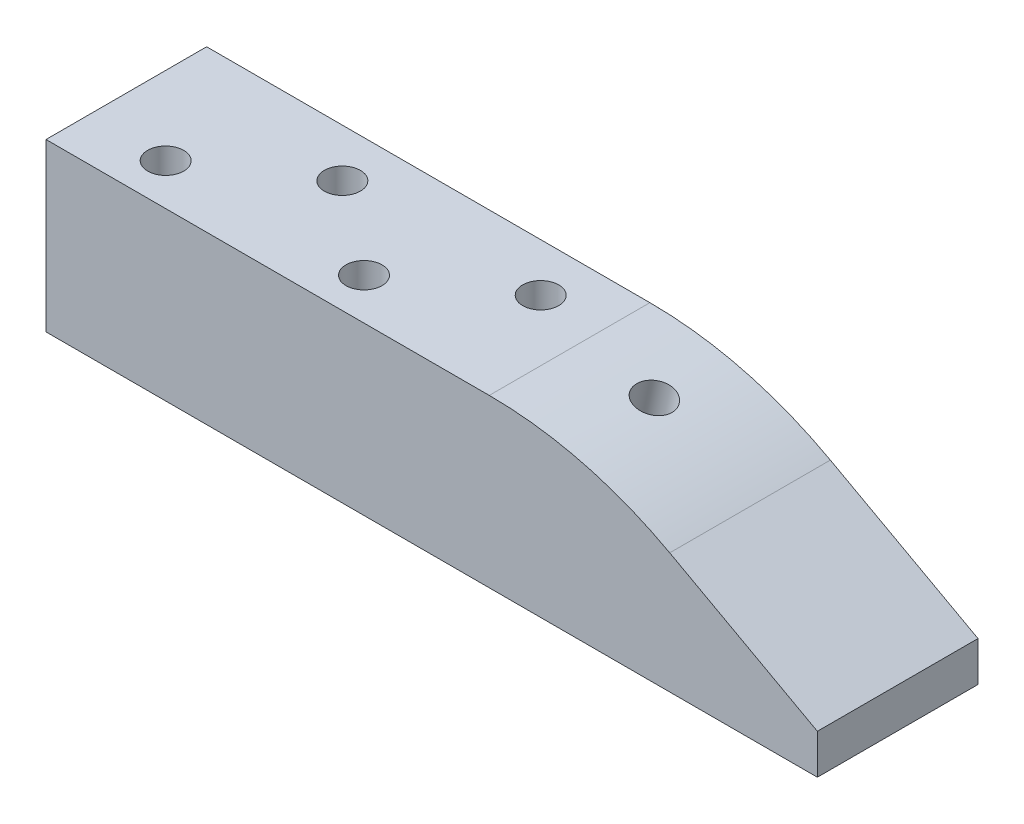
ISO-10303-21;
HEADER;
FILE_DESCRIPTION(('STEP AP214'),'2;1');
FILE_NAME('part.step','',(''),(''),'','','');
FILE_SCHEMA(('AUTOMOTIVE_DESIGN { 1 0 10303 214 1 1 1 1 }'));
ENDSEC;
DATA;
#1=APPLICATION_CONTEXT('core data for automotive mechanical design processes');
#2=APPLICATION_PROTOCOL_DEFINITION('international standard','automotive_design',2000,#1);
#3=PRODUCT_CONTEXT('',#1,'mechanical');
#4=PRODUCT('Part','Part','',(#3));
#5=PRODUCT_RELATED_PRODUCT_CATEGORY('part','',(#4));
#6=PRODUCT_DEFINITION_FORMATION('','',#4);
#7=PRODUCT_DEFINITION_CONTEXT('part definition',#1,'design');
#8=PRODUCT_DEFINITION('design','',#6,#7);
#9=PRODUCT_DEFINITION_SHAPE('','',#8);
#10=(LENGTH_UNIT() NAMED_UNIT(*) SI_UNIT(.MILLI.,.METRE.));
#11=(NAMED_UNIT(*) PLANE_ANGLE_UNIT() SI_UNIT($,.RADIAN.));
#12=(NAMED_UNIT(*) SI_UNIT($,.STERADIAN.) SOLID_ANGLE_UNIT());
#13=UNCERTAINTY_MEASURE_WITH_UNIT(LENGTH_MEASURE(1.E-05),#10,'distance_accuracy_value','');
#14=(GEOMETRIC_REPRESENTATION_CONTEXT(3) GLOBAL_UNCERTAINTY_ASSIGNED_CONTEXT((#13)) GLOBAL_UNIT_ASSIGNED_CONTEXT((#10,
#11,#12)) REPRESENTATION_CONTEXT('',''));
#15=CARTESIAN_POINT('',(0.,0.,0.));
#16=DIRECTION('',(0.,0.,1.));
#17=DIRECTION('',(1.,0.,0.));
#18=AXIS2_PLACEMENT_3D('',#15,#16,#17);
#19=CARTESIAN_POINT('',(-178.660059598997,92.4224475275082,-43.2877703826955));
#20=DIRECTION('',(1.,0.,0.));
#21=DIRECTION('',(0.,0.,-1.));
#22=AXIS2_PLACEMENT_3D('',#19,#20,#21);
#23=PLANE('',#22);
#24=DIRECTION('',(0.,0.,1.));
#25=VECTOR('',#24,1.);
#26=CARTESIAN_POINT('',(-178.660059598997,0.,-43.2877703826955));
#27=LINE('',#26,#25);
#28=CARTESIAN_POINT('',(-178.660059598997,0.,-43.2877703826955));
#29=VERTEX_POINT('',#28);
#30=CARTESIAN_POINT('',(-178.660059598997,0.,45.8024126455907));
#31=VERTEX_POINT('',#30);
#32=EDGE_CURVE('E147',#29,#31,#27,.T.);
#33=ORIENTED_EDGE('',*,*,#32,.T.);
#34=DIRECTION('',(0.,-1.,0.));
#35=VECTOR('',#34,1.);
#36=CARTESIAN_POINT('',(-178.660059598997,92.4224475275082,45.8024126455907));
#37=LINE('',#36,#35);
#38=CARTESIAN_POINT('',(-178.660059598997,92.4224475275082,45.8024126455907));
#39=VERTEX_POINT('',#38);
#40=EDGE_CURVE('E92',#39,#31,#37,.T.);
#41=ORIENTED_EDGE('',*,*,#40,.F.);
#42=DIRECTION('',(0.,0.,1.));
#43=VECTOR('',#42,1.);
#44=CARTESIAN_POINT('',(-178.660059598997,92.4224475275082,-43.2877703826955));
#45=LINE('',#44,#43);
#46=CARTESIAN_POINT('',(-178.660059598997,92.4224475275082,-43.2877703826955));
#47=VERTEX_POINT('',#46);
#48=EDGE_CURVE('E154',#47,#39,#45,.T.);
#49=ORIENTED_EDGE('',*,*,#48,.F.);
#50=DIRECTION('',(0.,-1.,0.));
#51=VECTOR('',#50,1.);
#52=CARTESIAN_POINT('',(-178.660059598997,92.4224475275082,-43.2877703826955));
#53=LINE('',#52,#51);
#54=EDGE_CURVE('E160',#47,#29,#53,.T.);
#55=ORIENTED_EDGE('',*,*,#54,.T.);
#56=EDGE_LOOP('',(#33,#41,#49,#55));
#57=FACE_BOUND('',#56,.T.);
#58=ADVANCED_FACE('F31',(#57),#23,.F.);
#59=CARTESIAN_POINT('',(-178.660059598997,92.4224475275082,45.8024126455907));
#60=DIRECTION('',(0.,0.,-1.));
#61=DIRECTION('',(-1.,0.,0.));
#62=AXIS2_PLACEMENT_3D('',#59,#60,#61);
#63=PLANE('',#62);
#64=DIRECTION('',(1.,0.,0.));
#65=VECTOR('',#64,1.);
#66=CARTESIAN_POINT('',(-178.660059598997,0.,45.8024126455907));
#67=LINE('',#66,#65);
#68=CARTESIAN_POINT('',(249.144823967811,0.,45.8024126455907));
#69=VERTEX_POINT('',#68);
#70=EDGE_CURVE('E150',#31,#69,#67,.T.);
#71=ORIENTED_EDGE('',*,*,#70,.T.);
#72=DIRECTION('',(0.,1.,0.));
#73=VECTOR('',#72,1.);
#74=CARTESIAN_POINT('',(249.144823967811,22.0839510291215,45.8024126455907));
#75=LINE('',#74,#73);
#76=CARTESIAN_POINT('',(249.144823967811,22.0839510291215,45.8024126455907));
#77=VERTEX_POINT('',#76);
#78=EDGE_CURVE('E115',#69,#77,#75,.T.);
#79=ORIENTED_EDGE('',*,*,#78,.T.);
#80=DIRECTION('',(-0.877433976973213,0.479697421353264,0.));
#81=VECTOR('',#80,1.);
#82=CARTESIAN_POINT('',(167.260924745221,66.8502768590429,45.8024126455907));
#83=LINE('',#82,#81);
#84=CARTESIAN_POINT('',(167.260924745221,66.8502768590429,45.8024126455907));
#85=VERTEX_POINT('',#84);
#86=EDGE_CURVE('E109',#77,#85,#83,.T.);
#87=ORIENTED_EDGE('',*,*,#86,.T.);
#88=CARTESIAN_POINT('',(67.1768718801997,-116.217516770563,45.8024126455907));
#89=DIRECTION('',(0.,0.,1.));
#90=DIRECTION('',(-1.,0.,0.));
#91=AXIS2_PLACEMENT_3D('',#88,#89,#90);
#92=CIRCLE('',#91,208.639964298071);
#93=CARTESIAN_POINT('',(67.1768718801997,92.4224475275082,45.8024126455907));
#94=VERTEX_POINT('',#93);
#95=EDGE_CURVE('E101',#85,#94,#92,.T.);
#96=ORIENTED_EDGE('',*,*,#95,.T.);
#97=DIRECTION('',(1.,0.,0.));
#98=VECTOR('',#97,1.);
#99=CARTESIAN_POINT('',(-178.660059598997,92.4224475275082,45.8024126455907));
#100=LINE('',#99,#98);
#101=EDGE_CURVE('E156',#39,#94,#100,.T.);
#102=ORIENTED_EDGE('',*,*,#101,.F.);
#103=ORIENTED_EDGE('',*,*,#40,.T.);
#104=EDGE_LOOP('',(#71,#79,#87,#96,#102,#103));
#105=FACE_BOUND('',#104,.T.);
#106=ADVANCED_FACE('F113',(#105),#63,.F.);
#107=CARTESIAN_POINT('',(-178.660059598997,92.4224475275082,-43.2877703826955));
#108=DIRECTION('',(0.,0.,1.));
#109=DIRECTION('',(1.,0.,0.));
#110=AXIS2_PLACEMENT_3D('',#107,#108,#109);
#111=PLANE('',#110);
#112=DIRECTION('',(-1.,0.,0.));
#113=VECTOR('',#112,1.);
#114=CARTESIAN_POINT('',(-178.660059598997,0.,-43.2877703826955));
#115=LINE('',#114,#113);
#116=CARTESIAN_POINT('',(249.144823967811,0.,-43.2877703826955));
#117=VERTEX_POINT('',#116);
#118=EDGE_CURVE('E152',#117,#29,#115,.T.);
#119=ORIENTED_EDGE('',*,*,#118,.T.);
#120=ORIENTED_EDGE('',*,*,#54,.F.);
#121=DIRECTION('',(-1.,0.,0.));
#122=VECTOR('',#121,1.);
#123=CARTESIAN_POINT('',(-178.660059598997,92.4224475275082,-43.2877703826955));
#124=LINE('',#123,#122);
#125=CARTESIAN_POINT('',(67.1768718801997,92.4224475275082,-43.2877703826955));
#126=VERTEX_POINT('',#125);
#127=EDGE_CURVE('E54',#126,#47,#124,.T.);
#128=ORIENTED_EDGE('',*,*,#127,.F.);
#129=CARTESIAN_POINT('',(67.1768718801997,-116.217516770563,-43.2877703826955));
#130=DIRECTION('',(0.,0.,1.));
#131=DIRECTION('',(-1.,0.,0.));
#132=AXIS2_PLACEMENT_3D('',#129,#130,#131);
#133=CIRCLE('',#132,208.639964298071);
#134=CARTESIAN_POINT('',(167.260924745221,66.8502768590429,-43.2877703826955));
#135=VERTEX_POINT('',#134);
#136=EDGE_CURVE('E127',#135,#126,#133,.T.);
#137=ORIENTED_EDGE('',*,*,#136,.F.);
#138=DIRECTION('',(-0.877433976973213,0.479697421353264,0.));
#139=VECTOR('',#138,1.);
#140=CARTESIAN_POINT('',(167.260924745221,66.8502768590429,-43.2877703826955));
#141=LINE('',#140,#139);
#142=CARTESIAN_POINT('',(249.144823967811,22.0839510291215,-43.2877703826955));
#143=VERTEX_POINT('',#142);
#144=EDGE_CURVE('E124',#143,#135,#141,.T.);
#145=ORIENTED_EDGE('',*,*,#144,.F.);
#146=DIRECTION('',(0.,1.,0.));
#147=VECTOR('',#146,1.);
#148=CARTESIAN_POINT('',(249.144823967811,22.0839510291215,-43.2877703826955));
#149=LINE('',#148,#147);
#150=EDGE_CURVE('E108',#117,#143,#149,.T.);
#151=ORIENTED_EDGE('',*,*,#150,.F.);
#152=EDGE_LOOP('',(#119,#120,#128,#137,#145,#151));
#153=FACE_BOUND('',#152,.T.);
#154=ADVANCED_FACE('F175',(#153),#111,.F.);
#155=CARTESIAN_POINT('',(-178.660059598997,92.4224475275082,45.8024126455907));
#156=DIRECTION('',(0.,1.,0.));
#157=DIRECTION('',(0.,0.,1.));
#158=AXIS2_PLACEMENT_3D('',#155,#156,#157);
#159=PLANE('',#158);
#160=CARTESIAN_POINT('',(-76.6620544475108,92.4224475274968,-16.559332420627));
#161=DIRECTION('',(0.,1.,0.));
#162=DIRECTION('',(0.,0.,1.));
#163=AXIS2_PLACEMENT_3D('',#160,#161,#162);
#164=CIRCLE('',#163,10.);
#165=CARTESIAN_POINT('',(-76.6620544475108,92.4224475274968,-6.55933242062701));
#166=VERTEX_POINT('',#165);
#167=EDGE_CURVE('E350',#166,#166,#164,.T.);
#168=ORIENTED_EDGE('',*,*,#167,.F.);
#169=EDGE_LOOP('',(#168));
#170=FACE_BOUND('',#169,.T.);
#171=CARTESIAN_POINT('',(-135.279241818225,92.4224475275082,22.8147983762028));
#172=DIRECTION('',(0.,1.,0.));
#173=DIRECTION('',(0.,0.,1.));
#174=AXIS2_PLACEMENT_3D('',#171,#172,#173);
#175=CIRCLE('',#174,10.);
#176=CARTESIAN_POINT('',(-135.279241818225,92.4224475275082,32.8147983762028));
#177=VERTEX_POINT('',#176);
#178=EDGE_CURVE('E349',#177,#177,#175,.T.);
#179=ORIENTED_EDGE('',*,*,#178,.F.);
#180=EDGE_LOOP('',(#179));
#181=FACE_BOUND('',#180,.T.);
#182=CARTESIAN_POINT('',(33.3379455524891,92.4224475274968,-16.559332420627));
#183=DIRECTION('',(0.,1.,0.));
#184=DIRECTION('',(0.,0.,1.));
#185=AXIS2_PLACEMENT_3D('',#182,#183,#184);
#186=CIRCLE('',#185,10.);
#187=CARTESIAN_POINT('',(33.3379455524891,92.4224475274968,-6.55933242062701));
#188=VERTEX_POINT('',#187);
#189=EDGE_CURVE('E131',#188,#188,#186,.T.);
#190=ORIENTED_EDGE('',*,*,#189,.F.);
#191=EDGE_LOOP('',(#190));
#192=FACE_BOUND('',#191,.T.);
#193=CARTESIAN_POINT('',(-25.2792418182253,92.4224475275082,22.8147983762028));
#194=DIRECTION('',(0.,1.,0.));
#195=DIRECTION('',(0.,0.,1.));
#196=AXIS2_PLACEMENT_3D('',#193,#194,#195);
#197=CIRCLE('',#196,10.);
#198=CARTESIAN_POINT('',(-25.2792418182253,92.4224475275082,32.8147983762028));
#199=VERTEX_POINT('',#198);
#200=EDGE_CURVE('E141',#199,#199,#197,.T.);
#201=ORIENTED_EDGE('',*,*,#200,.F.);
#202=EDGE_LOOP('',(#201));
#203=FACE_BOUND('',#202,.T.);
#204=ORIENTED_EDGE('',*,*,#48,.T.);
#205=ORIENTED_EDGE('',*,*,#101,.T.);
#206=DIRECTION('',(0.,0.,-1.));
#207=VECTOR('',#206,1.);
#208=CARTESIAN_POINT('',(67.1768718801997,92.4224475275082,-43.2877703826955));
#209=LINE('',#208,#207);
#210=EDGE_CURVE('E106',#94,#126,#209,.T.);
#211=ORIENTED_EDGE('',*,*,#210,.T.);
#212=ORIENTED_EDGE('',*,*,#127,.T.);
#213=EDGE_LOOP('',(#204,#205,#211,#212));
#214=FACE_BOUND('',#213,.T.);
#215=ADVANCED_FACE('F176',(#170,#181,#192,#203,#214),#159,.T.);
#216=CARTESIAN_POINT('',(-178.660059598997,0.,45.8024126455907));
#217=DIRECTION('',(0.,1.,0.));
#218=DIRECTION('',(0.,0.,1.));
#219=AXIS2_PLACEMENT_3D('',#216,#217,#218);
#220=PLANE('',#219);
#221=CARTESIAN_POINT('',(91.3563333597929,0.,-3.29323391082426));
#222=DIRECTION('',(0.,1.,0.));
#223=DIRECTION('',(1.,0.,0.));
#224=AXIS2_PLACEMENT_3D('',#221,#222,#223);
#225=ELLIPSE('',#224,10.2141385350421,9.99999999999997);
#226=CARTESIAN_POINT('',(101.570471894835,0.,-3.29323391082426));
#227=VERTEX_POINT('',#226);
#228=EDGE_CURVE('E118',#227,#227,#225,.T.);
#229=ORIENTED_EDGE('',*,*,#228,.T.);
#230=EDGE_LOOP('',(#229));
#231=FACE_BOUND('',#230,.T.);
#232=ORIENTED_EDGE('',*,*,#32,.F.);
#233=ORIENTED_EDGE('',*,*,#118,.F.);
#234=DIRECTION('',(0.,0.,1.));
#235=VECTOR('',#234,1.);
#236=CARTESIAN_POINT('',(249.144823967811,0.,-43.2877703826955));
#237=LINE('',#236,#235);
#238=EDGE_CURVE('E129',#117,#69,#237,.T.);
#239=ORIENTED_EDGE('',*,*,#238,.T.);
#240=ORIENTED_EDGE('',*,*,#70,.F.);
#241=EDGE_LOOP('',(#232,#233,#239,#240));
#242=FACE_BOUND('',#241,.T.);
#243=ADVANCED_FACE('F168',(#231,#242),#220,.F.);
#244=CARTESIAN_POINT('',(-25.2792418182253,52.4224475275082,22.8147983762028));
#245=DIRECTION('',(0.,1.,0.));
#246=DIRECTION('',(0.,0.,1.));
#247=AXIS2_PLACEMENT_3D('',#244,#245,#246);
#248=CYLINDRICAL_SURFACE('',#247,10.);
#249=CARTESIAN_POINT('',(-25.2792418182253,52.4224475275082,22.8147983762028));
#250=DIRECTION('',(0.,1.,0.));
#251=DIRECTION('',(0.,0.,1.));
#252=AXIS2_PLACEMENT_3D('',#249,#250,#251);
#253=CIRCLE('',#252,10.);
#254=CARTESIAN_POINT('',(-25.2792418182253,52.4224475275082,32.8147983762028));
#255=VERTEX_POINT('',#254);
#256=EDGE_CURVE('E144',#255,#255,#253,.T.);
#257=ORIENTED_EDGE('',*,*,#256,.F.);
#258=EDGE_LOOP('',(#257));
#259=FACE_BOUND('',#258,.T.);
#260=ORIENTED_EDGE('',*,*,#200,.T.);
#261=EDGE_LOOP('',(#260));
#262=FACE_BOUND('',#261,.T.);
#263=ADVANCED_FACE('F184',(#259,#262),#248,.F.);
#264=CARTESIAN_POINT('',(-25.2792418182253,52.4224475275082,22.8147983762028));
#265=DIRECTION('',(0.,1.,0.));
#266=DIRECTION('',(0.,0.,1.));
#267=AXIS2_PLACEMENT_3D('',#264,#265,#266);
#268=PLANE('',#267);
#269=ORIENTED_EDGE('',*,*,#256,.T.);
#270=EDGE_LOOP('',(#269));
#271=FACE_BOUND('',#270,.T.);
#272=ADVANCED_FACE('F297',(#271),#268,.T.);
#273=CARTESIAN_POINT('',(33.3379455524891,52.4224475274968,-16.559332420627));
#274=DIRECTION('',(0.,1.,0.));
#275=DIRECTION('',(0.,0.,1.));
#276=AXIS2_PLACEMENT_3D('',#273,#274,#275);
#277=CYLINDRICAL_SURFACE('',#276,10.);
#278=CARTESIAN_POINT('',(33.3379455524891,52.4224475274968,-16.559332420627));
#279=DIRECTION('',(0.,1.,0.));
#280=DIRECTION('',(0.,0.,1.));
#281=AXIS2_PLACEMENT_3D('',#278,#279,#280);
#282=CIRCLE('',#281,10.);
#283=CARTESIAN_POINT('',(33.3379455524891,52.4224475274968,-6.55933242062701));
#284=VERTEX_POINT('',#283);
#285=EDGE_CURVE('E138',#284,#284,#282,.T.);
#286=ORIENTED_EDGE('',*,*,#285,.F.);
#287=EDGE_LOOP('',(#286));
#288=FACE_BOUND('',#287,.T.);
#289=ORIENTED_EDGE('',*,*,#189,.T.);
#290=EDGE_LOOP('',(#289));
#291=FACE_BOUND('',#290,.T.);
#292=ADVANCED_FACE('F293',(#288,#291),#277,.F.);
#293=CARTESIAN_POINT('',(33.3379455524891,52.4224475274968,-16.559332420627));
#294=DIRECTION('',(0.,1.,0.));
#295=DIRECTION('',(0.,0.,1.));
#296=AXIS2_PLACEMENT_3D('',#293,#294,#295);
#297=PLANE('',#296);
#298=ORIENTED_EDGE('',*,*,#285,.T.);
#299=EDGE_LOOP('',(#298));
#300=FACE_BOUND('',#299,.T.);
#301=ADVANCED_FACE('F97',(#300),#297,.T.);
#302=CARTESIAN_POINT('',(67.1768718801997,-116.217516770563,-43.2877703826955));
#303=DIRECTION('',(0.,0.,1.));
#304=DIRECTION('',(1.,0.,0.));
#305=AXIS2_PLACEMENT_3D('',#302,#303,#304);
#306=CYLINDRICAL_SURFACE('',#305,208.639964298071);
#307=CARTESIAN_POINT('',(99.8359034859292,89.8504874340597,-3.29323391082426));
#308=CARTESIAN_POINT('',(99.8359012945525,89.8504875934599,-3.01245416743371));
#309=CARTESIAN_POINT('',(99.8476016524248,89.8486344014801,-2.73170956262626));
#310=CARTESIAN_POINT('',(99.8943176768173,89.8412224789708,-2.17212456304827));
#311=CARTESIAN_POINT('',(99.9293393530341,89.8356627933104,-1.89328467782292));
#312=CARTESIAN_POINT('',(100.022497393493,89.8208335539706,-1.33929848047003));
#313=CARTESIAN_POINT('',(100.080657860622,89.8115601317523,-1.06415633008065));
#314=CARTESIAN_POINT('',(100.219665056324,89.7893119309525,-0.51981020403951));
#315=CARTESIAN_POINT('',(100.300512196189,89.7763370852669,-0.250606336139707));
#316=CARTESIAN_POINT('',(100.484249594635,89.7467081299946,0.279802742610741));
#317=CARTESIAN_POINT('',(100.587128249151,89.7300559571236,0.541012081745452));
#318=CARTESIAN_POINT('',(100.814201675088,89.6930899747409,1.05373094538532));
#319=CARTESIAN_POINT('',(100.938396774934,89.672776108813,1.30524032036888));
#320=CARTESIAN_POINT('',(101.207162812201,89.6285240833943,1.79671404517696));
#321=CARTESIAN_POINT('',(101.351728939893,89.6045867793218,2.03668110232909));
#322=CARTESIAN_POINT('',(101.660203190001,89.5531298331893,2.50343002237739));
#323=CARTESIAN_POINT('',(101.824110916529,89.525610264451,2.73021215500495));
#324=CARTESIAN_POINT('',(102.170224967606,89.4670250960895,3.16917487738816));
#325=CARTESIAN_POINT('',(102.352446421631,89.4359565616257,3.38134314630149));
#326=CARTESIAN_POINT('',(102.7337525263,89.3703728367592,3.78936715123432));
#327=CARTESIAN_POINT('',(102.932837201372,89.3358576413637,3.98522286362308));
#328=CARTESIAN_POINT('',(103.346437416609,89.2634830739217,4.35924039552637));
#329=CARTESIAN_POINT('',(103.560953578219,89.2256235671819,4.53740150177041));
#330=CARTESIAN_POINT('',(104.003860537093,89.1466918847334,4.87475635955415));
#331=CARTESIAN_POINT('',(104.232251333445,89.1056197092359,5.03395011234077));
#332=CARTESIAN_POINT('',(104.701370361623,89.0204026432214,5.33230833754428));
#333=CARTESIAN_POINT('',(104.942104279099,88.9762563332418,5.47146346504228));
#334=CARTESIAN_POINT('',(105.434077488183,88.8851002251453,5.72866485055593));
#335=CARTESIAN_POINT('',(105.685316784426,88.8380904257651,5.84671109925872));
#336=CARTESIAN_POINT('',(106.196491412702,88.7414343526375,6.06085136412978));
#337=CARTESIAN_POINT('',(106.456426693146,88.6917880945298,6.15694551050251));
#338=CARTESIAN_POINT('',(106.983126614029,88.5901215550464,6.32649515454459));
#339=CARTESIAN_POINT('',(107.249891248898,88.5381012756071,6.39995067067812));
#340=CARTESIAN_POINT('',(107.788126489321,88.4320272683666,6.52364889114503));
#341=CARTESIAN_POINT('',(108.059593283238,88.3779751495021,6.57390956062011));
#342=CARTESIAN_POINT('',(108.605492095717,88.268134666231,6.65094208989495));
#343=CARTESIAN_POINT('',(108.879924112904,88.2123463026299,6.67771396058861));
#344=CARTESIAN_POINT('',(109.429791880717,88.0994042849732,6.70757687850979));
#345=CARTESIAN_POINT('',(109.705227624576,88.0422506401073,6.71066808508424));
#346=CARTESIAN_POINT('',(110.255142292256,87.9269816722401,6.69314791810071));
#347=CARTESIAN_POINT('',(110.529621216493,87.8688663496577,6.67253655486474));
#348=CARTESIAN_POINT('',(111.075447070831,87.7521565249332,6.60778576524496));
#349=CARTESIAN_POINT('',(111.346796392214,87.6935624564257,6.56366571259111));
#350=CARTESIAN_POINT('',(111.884673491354,87.5763078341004,6.45222525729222));
#351=CARTESIAN_POINT('',(112.151201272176,87.5176472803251,6.38490486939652));
#352=CARTESIAN_POINT('',(112.677557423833,87.4007412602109,6.22754441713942));
#353=CARTESIAN_POINT('',(112.937385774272,87.3424957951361,6.13750428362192));
#354=CARTESIAN_POINT('',(113.448517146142,87.2269184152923,5.93534658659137));
#355=CARTESIAN_POINT('',(113.699820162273,87.1695865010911,5.82322900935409));
#356=CARTESIAN_POINT('',(114.192243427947,87.056321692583,5.57766377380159));
#357=CARTESIAN_POINT('',(114.43335942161,87.0003893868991,5.44420730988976));
#358=CARTESIAN_POINT('',(114.903614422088,86.8904620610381,5.15694661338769));
#359=CARTESIAN_POINT('',(115.132753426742,86.8364670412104,5.00314237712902));
#360=CARTESIAN_POINT('',(115.577460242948,86.730924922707,4.67627714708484));
#361=CARTESIAN_POINT('',(115.793027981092,86.6793778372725,4.50321604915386));
#362=CARTESIAN_POINT('',(116.209093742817,86.5792330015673,4.13906458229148));
#363=CARTESIAN_POINT('',(116.409591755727,86.5306352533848,3.94797420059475));
#364=CARTESIAN_POINT('',(116.794321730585,86.436825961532,3.54891645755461));
#365=CARTESIAN_POINT('',(116.978537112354,86.3916178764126,3.34093229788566));
#366=CARTESIAN_POINT('',(117.329196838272,86.3051032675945,2.909729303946));
#367=CARTESIAN_POINT('',(117.495641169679,86.2637967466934,2.68651045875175));
#368=CARTESIAN_POINT('',(117.809604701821,86.1855149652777,2.22642096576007));
#369=CARTESIAN_POINT('',(117.957123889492,86.148539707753,1.98955030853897));
#370=CARTESIAN_POINT('',(118.232214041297,86.0793118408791,1.5038378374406));
#371=CARTESIAN_POINT('',(118.359785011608,86.0470592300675,1.25499602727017));
#372=CARTESIAN_POINT('',(118.594097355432,85.9876222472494,0.747100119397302));
#373=CARTESIAN_POINT('',(118.700838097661,85.9604380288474,0.488045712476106));
#374=CARTESIAN_POINT('',(118.892744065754,85.911434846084,-0.0384272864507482));
#375=CARTESIAN_POINT('',(118.977909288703,85.8896158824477,-0.305845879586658));
#376=CARTESIAN_POINT('',(119.126071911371,85.851583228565,-0.847143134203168));
#377=CARTESIAN_POINT('',(119.189069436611,85.8353695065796,-1.12102175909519));
#378=CARTESIAN_POINT('',(119.292459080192,85.8087268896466,-1.67328999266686));
#379=CARTESIAN_POINT('',(119.332851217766,85.7982979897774,-1.95167959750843));
#380=CARTESIAN_POINT('',(119.39072016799,85.78334868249,-2.51070715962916));
#381=CARTESIAN_POINT('',(119.408219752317,85.7788224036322,-2.79134260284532));
#382=CARTESIAN_POINT('',(119.420256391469,85.7757096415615,-3.3531382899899));
#383=CARTESIAN_POINT('',(119.414793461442,85.7771231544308,-3.63429853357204));
#384=CARTESIAN_POINT('',(119.380943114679,85.7858741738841,-4.19514205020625));
#385=CARTESIAN_POINT('',(119.352555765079,85.7932116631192,-4.47482532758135));
#386=CARTESIAN_POINT('',(119.273053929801,85.8137288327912,-5.03072586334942));
#387=CARTESIAN_POINT('',(119.221939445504,85.8269085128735,-5.30694312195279));
#388=CARTESIAN_POINT('',(119.097367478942,85.8589562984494,-5.8538197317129));
#389=CARTESIAN_POINT('',(119.02392044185,85.8778217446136,-6.12448161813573));
#390=CARTESIAN_POINT('',(118.855184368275,85.9210354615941,-6.65845935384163));
#391=CARTESIAN_POINT('',(118.759895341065,85.9453837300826,-6.92177520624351));
#392=CARTESIAN_POINT('',(118.548134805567,85.9992975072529,-7.43919514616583));
#393=CARTESIAN_POINT('',(118.431663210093,86.0288630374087,-7.69329919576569));
#394=CARTESIAN_POINT('',(118.178343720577,86.092892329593,-8.19049482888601));
#395=CARTESIAN_POINT('',(118.041495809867,86.127356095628,-8.43358640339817));
#396=CARTESIAN_POINT('',(117.748254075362,86.2008442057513,-8.90722404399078));
#397=CARTESIAN_POINT('',(117.591844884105,86.239872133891,-9.13776003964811));
#398=CARTESIAN_POINT('',(117.260648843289,86.3220573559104,-9.5844460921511));
#399=CARTESIAN_POINT('',(117.085861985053,86.3652146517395,-9.80059614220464));
#400=CARTESIAN_POINT('',(116.71912029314,86.4552144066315,-10.2169805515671));
#401=CARTESIAN_POINT('',(116.527165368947,86.5020568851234,-10.417214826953));
#402=CARTESIAN_POINT('',(116.127419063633,86.5989542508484,-10.8003479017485));
#403=CARTESIAN_POINT('',(115.919627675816,86.6490091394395,-10.9832466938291));
#404=CARTESIAN_POINT('',(115.489475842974,86.7518797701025,-11.3305535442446));
#405=CARTESIAN_POINT('',(115.267103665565,86.804697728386,-11.4949464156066));
#406=CARTESIAN_POINT('',(114.809491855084,86.9125486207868,-11.8039006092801));
#407=CARTESIAN_POINT('',(114.574252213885,86.9675815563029,-11.9484619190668));
#408=CARTESIAN_POINT('',(114.092550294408,87.0793473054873,-12.2167229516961));
#409=CARTESIAN_POINT('',(113.846088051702,87.1360801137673,-12.340422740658));
#410=CARTESIAN_POINT('',(113.343668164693,87.2507313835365,-12.5660786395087));
#411=CARTESIAN_POINT('',(113.087710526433,87.308649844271,-12.6680347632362));
#412=CARTESIAN_POINT('',(112.568212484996,87.4251401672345,-12.8494354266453));
#413=CARTESIAN_POINT('',(112.3046754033,87.4837117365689,-12.9288896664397));
#414=CARTESIAN_POINT('',(111.771771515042,87.6010399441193,-13.064776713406));
#415=CARTESIAN_POINT('',(111.502404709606,87.6597965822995,-13.1212095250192));
#416=CARTESIAN_POINT('',(110.959748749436,87.7770210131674,-13.2106491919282));
#417=CARTESIAN_POINT('',(110.686459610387,87.8354888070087,-13.2436561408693));
#418=CARTESIAN_POINT('',(110.137898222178,87.9516863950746,-13.2860076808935));
#419=CARTESIAN_POINT('',(109.862625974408,88.0094161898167,-13.295352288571));
#420=CARTESIAN_POINT('',(109.31233486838,88.1236595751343,-13.2903147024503));
#421=CARTESIAN_POINT('',(109.037316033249,88.1801743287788,-13.2759563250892));
#422=CARTESIAN_POINT('',(108.489214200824,88.2916597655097,-13.2236607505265));
#423=CARTESIAN_POINT('',(108.216131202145,88.3466304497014,-13.1857235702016));
#424=CARTESIAN_POINT('',(107.673849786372,88.4546746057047,-13.0865418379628));
#425=CARTESIAN_POINT('',(107.404651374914,88.5077480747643,-13.0252972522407));
#426=CARTESIAN_POINT('',(106.872064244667,88.6116804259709,-12.8799385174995));
#427=CARTESIAN_POINT('',(106.608675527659,88.6625393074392,-12.7958243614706));
#428=CARTESIAN_POINT('',(106.089591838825,88.761762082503,-12.6053261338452));
#429=CARTESIAN_POINT('',(105.833896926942,88.8101259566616,-12.4989418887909));
#430=CARTESIAN_POINT('',(105.332036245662,88.9041137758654,-12.2646618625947));
#431=CARTESIAN_POINT('',(105.085870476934,88.9497377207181,-12.1367660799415));
#432=CARTESIAN_POINT('',(104.604843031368,89.0380348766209,-11.860376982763));
#433=CARTESIAN_POINT('',(104.369980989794,89.0807081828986,-11.7118843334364));
#434=CARTESIAN_POINT('',(103.913240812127,89.1629296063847,-11.3953525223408));
#435=CARTESIAN_POINT('',(103.691362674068,89.2024777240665,-11.2273133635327));
#436=CARTESIAN_POINT('',(103.26199760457,89.2783371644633,-10.872722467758));
#437=CARTESIAN_POINT('',(103.054523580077,89.3146455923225,-10.6861544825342));
#438=CARTESIAN_POINT('',(102.655677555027,89.3838694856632,-10.2959493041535));
#439=CARTESIAN_POINT('',(102.464305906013,89.4167848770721,-10.0923117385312));
#440=CARTESIAN_POINT('',(102.099011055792,89.4791367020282,-9.66936243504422));
#441=CARTESIAN_POINT('',(101.925092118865,89.5085722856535,-9.45004688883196));
#442=CARTESIAN_POINT('',(101.596021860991,89.5638834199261,-8.99734410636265));
#443=CARTESIAN_POINT('',(101.440870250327,89.5897590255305,-8.76395708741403));
#444=CARTESIAN_POINT('',(101.150325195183,89.637920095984,-8.28453745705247));
#445=CARTESIAN_POINT('',(101.014950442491,89.6602021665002,-8.03849317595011));
#446=CARTESIAN_POINT('',(100.76512641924,89.701107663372,-7.53571626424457));
#447=CARTESIAN_POINT('',(100.650676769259,89.7197311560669,-7.27898382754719));
#448=CARTESIAN_POINT('',(100.443648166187,89.7532755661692,-6.75692107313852));
#449=CARTESIAN_POINT('',(100.351046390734,89.7682003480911,-6.49160005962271));
#450=CARTESIAN_POINT('',(100.188262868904,89.7943507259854,-5.95408380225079));
#451=CARTESIAN_POINT('',(100.118075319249,89.8055772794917,-5.68189035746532));
#452=CARTESIAN_POINT('',(99.9851608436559,89.826790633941,-5.06022207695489));
#453=CARTESIAN_POINT('',(99.9292397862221,89.8356766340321,-4.70923314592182));
#454=CARTESIAN_POINT('',(99.8546125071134,89.8475249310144,-4.00322205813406));
#455=CARTESIAN_POINT('',(99.8359062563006,89.8504872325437,-3.64819990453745));
#456=CARTESIAN_POINT('',(99.8359034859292,89.8504874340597,-3.29323391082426));
#457=B_SPLINE_CURVE_WITH_KNOTS('',3,(#307,#308,#309,#310,#311,#312,#313,#314,#315,#316,#317,
#318,#319,#320,#321,#322,#323,#324,#325,#326,#327,#328,#329,#330,#331,#332,#333,#334,#335,#336,
#337,#338,#339,#340,#341,#342,#343,#344,#345,#346,#347,#348,#349,#350,#351,#352,#353,#354,#355,
#356,#357,#358,#359,#360,#361,#362,#363,#364,#365,#366,#367,#368,#369,#370,#371,#372,#373,#374,
#375,#376,#377,#378,#379,#380,#381,#382,#383,#384,#385,#386,#387,#388,#389,#390,#391,#392,#393,
#394,#395,#396,#397,#398,#399,#400,#401,#402,#403,#404,#405,#406,#407,#408,#409,#410,#411,#412,
#413,#414,#415,#416,#417,#418,#419,#420,#421,#422,#423,#424,#425,#426,#427,#428,#429,#430,#431,
#432,#433,#434,#435,#436,#437,#438,#439,#440,#441,#442,#443,#444,#445,#446,#447,#448,#449,#450,
#451,#452,#453,#454,#455,#456),.UNSPECIFIED.,.T.,.F.,(4,2,2,2,2,2,2,2,2,2,2,2,2,2,2,2,2,2,2,2,2,
2,2,2,2,2,2,2,2,2,2,2,2,2,2,2,2,2,2,2,2,2,2,2,2,2,2,2,2,2,2,2,2,2,2,2,2,2,2,2,2,2,2,2,2,2,2,2,2,
2,2,2,2,2,4),(0.,0.84202908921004,1.6842752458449,2.52740104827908,3.37054213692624,
4.21324022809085,5.05595130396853,5.89846374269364,6.74095893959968,7.58415595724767,
8.42735419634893,9.27058641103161,10.1138185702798,10.9574427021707,11.801067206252,
12.6446867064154,13.4883055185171,14.3312698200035,15.1742337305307,16.0171919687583,
16.8601498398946,17.7024140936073,18.5446778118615,19.386944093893,20.2292108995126,
21.0718261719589,21.9144415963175,22.7570615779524,23.5996821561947,24.4431510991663,
25.2866206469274,26.1300907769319,26.9735606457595,27.8170560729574,28.6605516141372,
29.5040423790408,30.3475324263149,31.1901827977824,32.032832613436,32.8754799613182,
33.7181272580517,34.5603810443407,35.40263447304,36.2448913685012,37.087148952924,
37.9300724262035,38.772996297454,39.6159246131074,40.4588532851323,41.3024687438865,
42.1460847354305,42.9896980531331,43.8333108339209,44.6765593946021,45.5198077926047,
46.3630528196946,47.2062972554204,48.0486949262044,48.8910919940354,49.7334902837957,
50.5758888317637,51.4182939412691,52.260699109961,53.1030770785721,53.9454549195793,
54.7885780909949,55.6317196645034,56.4750667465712,57.3184008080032,58.1625268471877,
59.0066375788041,59.849862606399,60.6928691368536,61.7573758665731,62.8218817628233),.UNSPECIFIED.);
#458=CARTESIAN_POINT('',(109.675096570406,88.0483286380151,6.70676608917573));
#459=VERTEX_POINT('',#458);
#460=CARTESIAN_POINT('',(109.675096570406,88.0483286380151,-13.2932339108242));
#461=VERTEX_POINT('',#460);
#462=EDGE_CURVE('E11',#459,#461,#457,.T.);
#463=ORIENTED_EDGE('',*,*,#462,.F.);
#464=EDGE_CURVE('E34',#461,#459,#457,.T.);
#465=ORIENTED_EDGE('',*,*,#464,.F.);
#466=EDGE_LOOP('',(#463,#465));
#467=FACE_BOUND('',#466,.T.);
#468=ORIENTED_EDGE('',*,*,#95,.F.);
#469=DIRECTION('',(0.,0.,1.));
#470=VECTOR('',#469,1.);
#471=CARTESIAN_POINT('',(167.260924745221,66.8502768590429,-43.2877703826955));
#472=LINE('',#471,#470);
#473=EDGE_CURVE('E104',#135,#85,#472,.T.);
#474=ORIENTED_EDGE('',*,*,#473,.F.);
#475=ORIENTED_EDGE('',*,*,#136,.T.);
#476=ORIENTED_EDGE('',*,*,#210,.F.);
#477=EDGE_LOOP('',(#468,#474,#475,#476));
#478=FACE_BOUND('',#477,.T.);
#479=ADVANCED_FACE('F93',(#467,#478),#306,.T.);
#480=CARTESIAN_POINT('',(167.260924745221,66.8502768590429,-43.2877703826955));
#481=DIRECTION('',(0.479697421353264,0.877433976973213,0.));
#482=DIRECTION('',(-0.877433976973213,0.479697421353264,0.));
#483=AXIS2_PLACEMENT_3D('',#480,#481,#482);
#484=PLANE('',#483);
#485=ORIENTED_EDGE('',*,*,#86,.F.);
#486=DIRECTION('',(0.,0.,1.));
#487=VECTOR('',#486,1.);
#488=CARTESIAN_POINT('',(249.144823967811,22.0839510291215,-43.2877703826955));
#489=LINE('',#488,#487);
#490=EDGE_CURVE('E132',#143,#77,#489,.T.);
#491=ORIENTED_EDGE('',*,*,#490,.F.);
#492=ORIENTED_EDGE('',*,*,#144,.T.);
#493=ORIENTED_EDGE('',*,*,#473,.T.);
#494=EDGE_LOOP('',(#485,#491,#492,#493));
#495=FACE_BOUND('',#494,.T.);
#496=ADVANCED_FACE('F96',(#495),#484,.T.);
#497=CARTESIAN_POINT('',(249.144823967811,22.0839510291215,-43.2877703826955));
#498=DIRECTION('',(1.,0.,0.));
#499=DIRECTION('',(0.,0.,-1.));
#500=AXIS2_PLACEMENT_3D('',#497,#498,#499);
#501=PLANE('',#500);
#502=ORIENTED_EDGE('',*,*,#78,.F.);
#503=ORIENTED_EDGE('',*,*,#238,.F.);
#504=ORIENTED_EDGE('',*,*,#150,.T.);
#505=ORIENTED_EDGE('',*,*,#490,.T.);
#506=EDGE_LOOP('',(#502,#503,#504,#505));
#507=FACE_BOUND('',#506,.T.);
#508=ADVANCED_FACE('F172',(#507),#501,.T.);
#509=CARTESIAN_POINT('',(109.675096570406,88.0483286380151,-3.29323391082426));
#510=DIRECTION('',(0.203691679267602,0.979035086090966,0.));
#511=DIRECTION('',(-0.979035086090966,0.203691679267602,0.));
#512=AXIS2_PLACEMENT_3D('',#509,#510,#511);
#513=CYLINDRICAL_SURFACE('',#512,9.99999999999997);
#514=ORIENTED_EDGE('',*,*,#462,.T.);
#515=ORIENTED_EDGE('',*,*,#464,.T.);
#516=EDGE_LOOP('',(#514,#515));
#517=FACE_BOUND('',#516,.T.);
#518=ORIENTED_EDGE('',*,*,#228,.F.);
#519=EDGE_LOOP('',(#518));
#520=FACE_BOUND('',#519,.T.);
#521=ADVANCED_FACE('F89',(#517,#520),#513,.F.);
#522=CARTESIAN_POINT('',(-135.279241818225,52.4224475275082,22.8147983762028));
#523=DIRECTION('',(0.,1.,0.));
#524=DIRECTION('',(0.,0.,1.));
#525=AXIS2_PLACEMENT_3D('',#522,#523,#524);
#526=CYLINDRICAL_SURFACE('',#525,10.);
#527=CARTESIAN_POINT('',(-135.279241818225,52.4224475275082,22.8147983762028));
#528=DIRECTION('',(0.,1.,0.));
#529=DIRECTION('',(0.,0.,1.));
#530=AXIS2_PLACEMENT_3D('',#527,#528,#529);
#531=CIRCLE('',#530,10.);
#532=CARTESIAN_POINT('',(-135.279241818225,52.4224475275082,32.8147983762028));
#533=VERTEX_POINT('',#532);
#534=EDGE_CURVE('E353',#533,#533,#531,.T.);
#535=ORIENTED_EDGE('',*,*,#534,.F.);
#536=EDGE_LOOP('',(#535));
#537=FACE_BOUND('',#536,.T.);
#538=ORIENTED_EDGE('',*,*,#178,.T.);
#539=EDGE_LOOP('',(#538));
#540=FACE_BOUND('',#539,.T.);
#541=ADVANCED_FACE('F241',(#537,#540),#526,.F.);
#542=CARTESIAN_POINT('',(-135.279241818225,52.4224475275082,22.8147983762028));
#543=DIRECTION('',(0.,1.,0.));
#544=DIRECTION('',(0.,0.,1.));
#545=AXIS2_PLACEMENT_3D('',#542,#543,#544);
#546=PLANE('',#545);
#547=ORIENTED_EDGE('',*,*,#534,.T.);
#548=EDGE_LOOP('',(#547));
#549=FACE_BOUND('',#548,.T.);
#550=ADVANCED_FACE('F242',(#549),#546,.T.);
#551=CARTESIAN_POINT('',(-76.6620544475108,52.4224475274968,-16.559332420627));
#552=DIRECTION('',(0.,1.,0.));
#553=DIRECTION('',(0.,0.,1.));
#554=AXIS2_PLACEMENT_3D('',#551,#552,#553);
#555=CYLINDRICAL_SURFACE('',#554,10.);
#556=CARTESIAN_POINT('',(-76.6620544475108,52.4224475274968,-16.559332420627));
#557=DIRECTION('',(0.,1.,0.));
#558=DIRECTION('',(0.,0.,1.));
#559=AXIS2_PLACEMENT_3D('',#556,#557,#558);
#560=CIRCLE('',#559,10.);
#561=CARTESIAN_POINT('',(-76.6620544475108,52.4224475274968,-6.55933242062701));
#562=VERTEX_POINT('',#561);
#563=EDGE_CURVE('E348',#562,#562,#560,.T.);
#564=ORIENTED_EDGE('',*,*,#563,.F.);
#565=EDGE_LOOP('',(#564));
#566=FACE_BOUND('',#565,.T.);
#567=ORIENTED_EDGE('',*,*,#167,.T.);
#568=EDGE_LOOP('',(#567));
#569=FACE_BOUND('',#568,.T.);
#570=ADVANCED_FACE('F257',(#566,#569),#555,.F.);
#571=CARTESIAN_POINT('',(-76.6620544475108,52.4224475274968,-16.559332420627));
#572=DIRECTION('',(0.,1.,0.));
#573=DIRECTION('',(0.,0.,1.));
#574=AXIS2_PLACEMENT_3D('',#571,#572,#573);
#575=PLANE('',#574);
#576=ORIENTED_EDGE('',*,*,#563,.T.);
#577=EDGE_LOOP('',(#576));
#578=FACE_BOUND('',#577,.T.);
#579=ADVANCED_FACE('F274',(#578),#575,.T.);
#580=CLOSED_SHELL('',(#58,#106,#154,#215,#243,#263,#272,#292,#301,#479,#496,#508,#521,#541,#550,
#570,#579));
#581=MANIFOLD_SOLID_BREP('B2',#580);
#582=ADVANCED_BREP_SHAPE_REPRESENTATION('',(#18,#581),#14);
#583=SHAPE_DEFINITION_REPRESENTATION(#9,#582);
ENDSEC;
END-ISO-10303-21;
